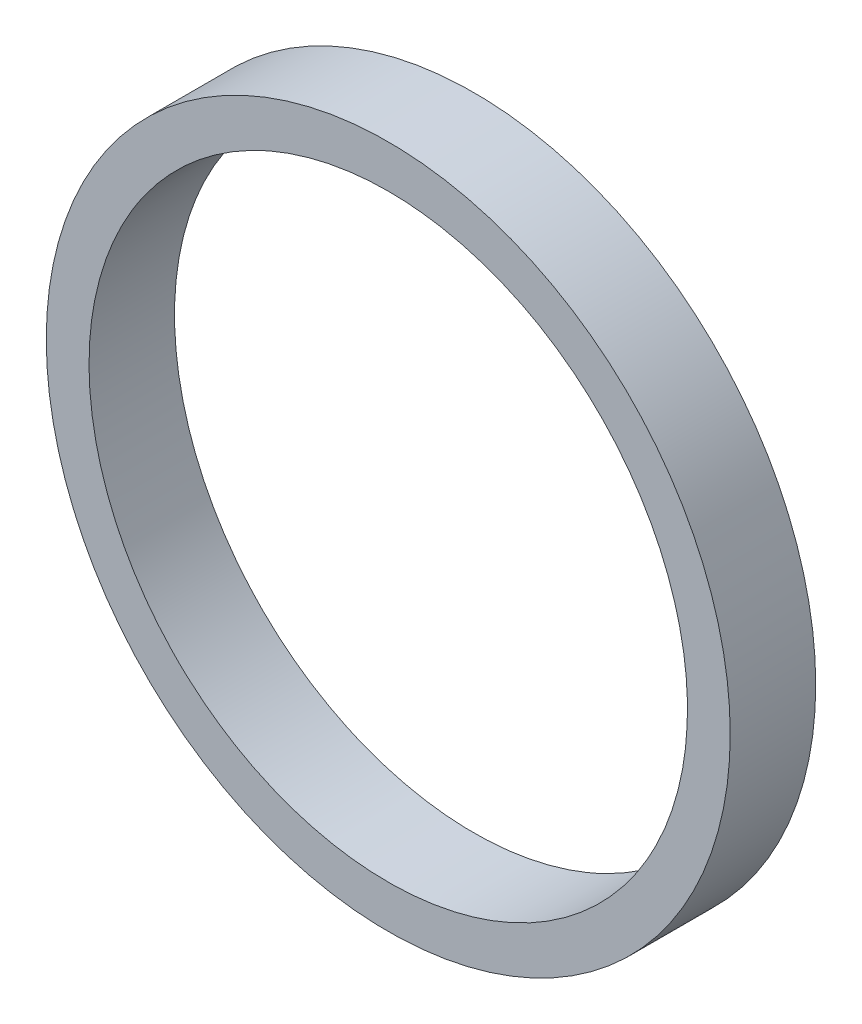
ISO-10303-21;
HEADER;
FILE_DESCRIPTION(('STEP AP214'),'2;1');
FILE_NAME('part.step','',(''),(''),'','','');
FILE_SCHEMA(('AUTOMOTIVE_DESIGN { 1 0 10303 214 1 1 1 1 }'));
ENDSEC;
DATA;
#1=APPLICATION_CONTEXT('core data for automotive mechanical design processes');
#2=APPLICATION_PROTOCOL_DEFINITION('international standard','automotive_design',2000,#1);
#3=PRODUCT_CONTEXT('',#1,'mechanical');
#4=PRODUCT('Part','Part','',(#3));
#5=PRODUCT_RELATED_PRODUCT_CATEGORY('part','',(#4));
#6=PRODUCT_DEFINITION_FORMATION('','',#4);
#7=PRODUCT_DEFINITION_CONTEXT('part definition',#1,'design');
#8=PRODUCT_DEFINITION('design','',#6,#7);
#9=PRODUCT_DEFINITION_SHAPE('','',#8);
#10=(LENGTH_UNIT() NAMED_UNIT(*) SI_UNIT(.MILLI.,.METRE.));
#11=(NAMED_UNIT(*) PLANE_ANGLE_UNIT() SI_UNIT($,.RADIAN.));
#12=(NAMED_UNIT(*) SI_UNIT($,.STERADIAN.) SOLID_ANGLE_UNIT());
#13=UNCERTAINTY_MEASURE_WITH_UNIT(LENGTH_MEASURE(1.E-05),#10,'distance_accuracy_value','');
#14=(GEOMETRIC_REPRESENTATION_CONTEXT(3) GLOBAL_UNCERTAINTY_ASSIGNED_CONTEXT((#13)) GLOBAL_UNIT_ASSIGNED_CONTEXT((#10,
#11,#12)) REPRESENTATION_CONTEXT('',''));
#15=CARTESIAN_POINT('',(0.,0.,0.));
#16=DIRECTION('',(0.,0.,1.));
#17=DIRECTION('',(1.,0.,0.));
#18=AXIS2_PLACEMENT_3D('',#15,#16,#17);
#19=CARTESIAN_POINT('',(0.,0.,10.));
#20=DIRECTION('',(0.,0.,1.));
#21=DIRECTION('',(1.,0.,0.));
#22=AXIS2_PLACEMENT_3D('',#19,#20,#21);
#23=PLANE('',#22);
#24=CARTESIAN_POINT('',(0.,0.,10.));
#25=DIRECTION('',(0.,0.,1.));
#26=DIRECTION('',(1.,0.,0.));
#27=AXIS2_PLACEMENT_3D('',#24,#25,#26);
#28=CIRCLE('',#27,40.);
#29=CARTESIAN_POINT('',(40.,0.,10.));
#30=VERTEX_POINT('',#29);
#31=EDGE_CURVE('E10',#30,#30,#28,.T.);
#32=ORIENTED_EDGE('',*,*,#31,.T.);
#33=EDGE_LOOP('',(#32));
#34=FACE_BOUND('',#33,.T.);
#35=CARTESIAN_POINT('',(-1.0192360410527E-08,34.9989192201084,10.));
#36=CARTESIAN_POINT('',(-0.575875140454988,34.9989668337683,10.));
#37=CARTESIAN_POINT('',(-1.15175923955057,34.9848477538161,10.));
#38=CARTESIAN_POINT('',(-2.29873508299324,34.928374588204,10.));
#39=CARTESIAN_POINT('',(-2.86983506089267,34.8861875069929,10.));
#40=CARTESIAN_POINT('',(-4.00728748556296,34.7738724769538,10.));
#41=CARTESIAN_POINT('',(-4.57364952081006,34.7038416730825,10.));
#42=CARTESIAN_POINT('',(-5.70168014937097,34.5362533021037,10.));
#43=CARTESIAN_POINT('',(-6.26335300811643,34.4387244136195,10.));
#44=CARTESIAN_POINT('',(-7.38205016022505,34.2163480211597,10.));
#45=CARTESIAN_POINT('',(-7.939067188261,34.0914639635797,10.));
#46=CARTESIAN_POINT('',(-9.04840641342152,33.8140522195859,10.));
#47=CARTESIAN_POINT('',(-9.60070305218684,33.6614222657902,10.));
#48=CARTESIAN_POINT('',(-10.7001970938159,33.328215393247,10.));
#49=CARTESIAN_POINT('',(-11.2473482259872,33.1474858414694,10.));
#50=CARTESIAN_POINT('',(-12.3317275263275,32.7595498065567,10.));
#51=CARTESIAN_POINT('',(-12.8689626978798,32.5523628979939,10.));
#52=CARTESIAN_POINT('',(-13.9293538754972,32.1130639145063,10.));
#53=CARTESIAN_POINT('',(-14.4525752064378,31.8811095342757,10.));
#54=CARTESIAN_POINT('',(-15.4854000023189,31.392620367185,10.));
#55=CARTESIAN_POINT('',(-15.9950411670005,31.1361652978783,10.));
#56=CARTESIAN_POINT('',(-17.0007185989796,30.5987016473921,10.));
#57=CARTESIAN_POINT('',(-17.4967647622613,30.31771158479,10.));
#58=CARTESIAN_POINT('',(-18.4753427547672,29.7313522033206,10.));
#59=CARTESIAN_POINT('',(-18.9578508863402,29.4259433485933,10.));
#60=CARTESIAN_POINT('',(-19.9093529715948,28.790705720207,10.));
#61=CARTESIAN_POINT('',(-20.3782841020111,28.4607828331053,10.));
#62=CARTESIAN_POINT('',(-21.3021251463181,27.7762159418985,10.));
#63=CARTESIAN_POINT('',(-21.7569336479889,27.4214350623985,10.));
#64=CARTESIAN_POINT('',(-22.6471341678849,26.6909845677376,10.));
#65=CARTESIAN_POINT('',(-23.0825812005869,26.3153819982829,10.));
#66=CARTESIAN_POINT('',(-23.932145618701,25.5451658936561,10.));
#67=CARTESIAN_POINT('',(-24.3463633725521,25.150663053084,10.));
#68=CARTESIAN_POINT('',(-25.1539339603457,24.343087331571,10.));
#69=CARTESIAN_POINT('',(-25.5473426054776,23.9300702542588,10.));
#70=CARTESIAN_POINT('',(-26.3133246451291,23.0854820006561,10.));
#71=CARTESIAN_POINT('',(-26.6859073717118,22.6539192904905,10.));
#72=CARTESIAN_POINT('',(-27.4101262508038,21.772146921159,10.));
#73=CARTESIAN_POINT('',(-27.7617199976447,21.321902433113,10.));
#74=CARTESIAN_POINT('',(-28.4439317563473,20.402731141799,10.));
#75=CARTESIAN_POINT('',(-28.7744510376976,19.9337310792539,10.));
#76=CARTESIAN_POINT('',(-29.4139521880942,18.9774236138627,10.));
#77=CARTESIAN_POINT('',(-29.7228016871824,18.4900276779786,10.));
#78=CARTESIAN_POINT('',(-30.3147556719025,17.5026156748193,10.));
#79=CARTESIAN_POINT('',(-30.597962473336,17.0026609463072,10.));
#80=CARTESIAN_POINT('',(-31.1381125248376,15.9919470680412,10.));
#81=CARTESIAN_POINT('',(-31.3951790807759,15.4812538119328,10.));
#82=CARTESIAN_POINT('',(-31.8833286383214,14.449183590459,10.));
#83=CARTESIAN_POINT('',(-32.1144759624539,13.9278370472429,10.));
#84=CARTESIAN_POINT('',(-32.5510388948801,12.8745680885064,10.));
#85=CARTESIAN_POINT('',(-32.7564582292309,12.3426472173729,10.));
#86=CARTESIAN_POINT('',(-33.1414595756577,11.2681830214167,10.));
#87=CARTESIAN_POINT('',(-33.320982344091,10.7256184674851,10.));
#88=CARTESIAN_POINT('',(-33.6540627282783,9.62979888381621,10.));
#89=CARTESIAN_POINT('',(-33.8074947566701,9.07650567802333,10.));
#90=CARTESIAN_POINT('',(-34.0876252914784,7.96022114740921,10.));
#91=CARTESIAN_POINT('',(-34.214184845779,7.39719495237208,10.));
#92=CARTESIAN_POINT('',(-34.4388783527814,6.2684487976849,10.));
#93=CARTESIAN_POINT('',(-34.5371522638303,5.70275668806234,10.));
#94=CARTESIAN_POINT('',(-34.7053504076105,4.56986486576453,10.));
#95=CARTESIAN_POINT('',(-34.7754046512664,4.00268447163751,10.));
#96=CARTESIAN_POINT('',(-34.8873679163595,2.86683781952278,10.));
#97=CARTESIAN_POINT('',(-34.9293397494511,2.29817775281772,10.));
#98=CARTESIAN_POINT('',(-34.9854421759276,1.15939766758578,10.));
#99=CARTESIAN_POINT('',(-34.9995682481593,0.589277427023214,10.));
#100=CARTESIAN_POINT('',(-35.000103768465,-0.552432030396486,10.));
#101=CARTESIAN_POINT('',(-34.9864424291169,-1.12402128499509,10.));
#102=CARTESIAN_POINT('',(-34.9309281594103,-2.26869596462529,10.));
#103=CARTESIAN_POINT('',(-34.8889345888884,-2.84177457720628,10.));
#104=CARTESIAN_POINT('',(-34.7766002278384,-3.98755439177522,10.));
#105=CARTESIAN_POINT('',(-34.7061422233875,-4.56024410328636,10.));
#106=CARTESIAN_POINT('',(-34.5374432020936,-5.69820491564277,10.));
#107=CARTESIAN_POINT('',(-34.439361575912,-6.26349965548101,10.));
#108=CARTESIAN_POINT('',(-34.2161454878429,-7.38617310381,10.));
#109=CARTESIAN_POINT('',(-34.0911301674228,-7.94357550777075,10.));
#110=CARTESIAN_POINT('',(-33.8142284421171,-9.05052095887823,10.));
#111=CARTESIAN_POINT('',(-33.6623946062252,-9.60007714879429,10.));
#112=CARTESIAN_POINT('',(-33.3318330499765,-10.6913168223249,10.));
#113=CARTESIAN_POINT('',(-33.1530929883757,-11.2329965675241,10.));
#114=CARTESIAN_POINT('',(-32.7687977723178,-12.3085075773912,10.));
#115=CARTESIAN_POINT('',(-32.5631671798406,-12.8423118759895,10.));
#116=CARTESIAN_POINT('',(-32.1249544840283,-13.9020573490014,10.));
#117=CARTESIAN_POINT('',(-31.892235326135,-14.4279418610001,10.));
#118=CARTESIAN_POINT('',(-31.40039800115,-15.4691540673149,10.));
#119=CARTESIAN_POINT('',(-31.1412025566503,-15.9844452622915,10.));
#120=CARTESIAN_POINT('',(-30.5993353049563,-16.9985660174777,10.));
#121=CARTESIAN_POINT('',(-30.3168134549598,-17.4974757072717,10.));
#122=CARTESIAN_POINT('',(-29.7287365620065,-18.4787906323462,10.));
#123=CARTESIAN_POINT('',(-29.4232791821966,-18.9612544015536,10.));
#124=CARTESIAN_POINT('',(-28.789773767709,-19.9099776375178,10.));
#125=CARTESIAN_POINT('',(-28.4617633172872,-20.3762622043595,10.));
#126=CARTESIAN_POINT('',(-27.7830902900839,-21.2925947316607,10.));
#127=CARTESIAN_POINT('',(-27.4324108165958,-21.7426301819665,10.));
#128=CARTESIAN_POINT('',(-26.7081980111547,-22.6263162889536,10.));
#129=CARTESIAN_POINT('',(-26.3345955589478,-23.0599102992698,10.));
#130=CARTESIAN_POINT('',(-25.5644125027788,-23.9106402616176,10.));
#131=CARTESIAN_POINT('',(-25.1677142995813,-24.3276697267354,10.));
#132=CARTESIAN_POINT('',(-24.3538646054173,-25.1422102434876,10.));
#133=CARTESIAN_POINT('',(-23.936690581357,-25.5396987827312,10.));
#134=CARTESIAN_POINT('',(-23.0854296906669,-26.3115787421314,10.));
#135=CARTESIAN_POINT('',(-22.6514417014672,-26.686079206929,10.));
#136=CARTESIAN_POINT('',(-21.7674638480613,-27.4118191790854,10.));
#137=CARTESIAN_POINT('',(-21.317548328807,-27.7631492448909,10.));
#138=CARTESIAN_POINT('',(-20.4016635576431,-28.4429056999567,10.));
#139=CARTESIAN_POINT('',(-19.9357164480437,-28.7713619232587,10.));
#140=CARTESIAN_POINT('',(-18.9878583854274,-29.4054977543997,10.));
#141=CARTESIAN_POINT('',(-18.5059310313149,-29.711152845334,10.));
#142=CARTESIAN_POINT('',(-17.5260053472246,-30.2995541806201,10.));
#143=CARTESIAN_POINT('',(-17.027957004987,-30.5822171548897,10.));
#144=CARTESIAN_POINT('',(-16.015567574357,-31.1242745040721,10.));
#145=CARTESIAN_POINT('',(-15.5011476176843,-31.3835215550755,10.));
#146=CARTESIAN_POINT('',(-14.4602374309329,-31.8764742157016,10.));
#147=CARTESIAN_POINT('',(-13.9337476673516,-32.110180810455,10.));
#148=CARTESIAN_POINT('',(-12.8730032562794,-32.5500233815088,10.));
#149=CARTESIAN_POINT('',(-12.3388125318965,-32.7563135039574,10.));
#150=CARTESIAN_POINT('',(-11.262813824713,-33.1418031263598,10.));
#151=CARTESIAN_POINT('',(-10.7210383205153,-33.3210932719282,10.));
#152=CARTESIAN_POINT('',(-9.62988582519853,-33.6526322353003,10.));
#153=CARTESIAN_POINT('',(-9.0805172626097,-33.8049087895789,10.));
#154=CARTESIAN_POINT('',(-7.97424558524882,-34.0826367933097,10.));
#155=CARTESIAN_POINT('',(-7.41733318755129,-34.2080512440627,10.));
#156=CARTESIAN_POINT('',(-6.29567663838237,-34.4320845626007,10.));
#157=CARTESIAN_POINT('',(-5.73090923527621,-34.530587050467,10.));
#158=CARTESIAN_POINT('',(-4.59430584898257,-34.7001565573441,10.));
#159=CARTESIAN_POINT('',(-4.02244846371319,-34.7710801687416,10.));
#160=CARTESIAN_POINT('',(-2.87665345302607,-34.8845723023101,10.));
#161=CARTESIAN_POINT('',(-2.30271935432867,-34.9271764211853,10.));
#162=CARTESIAN_POINT('',(-1.15664677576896,-34.9838106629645,10.));
#163=CARTESIAN_POINT('',(-0.584516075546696,-34.9979984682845,10.));
#164=CARTESIAN_POINT('',(0.557970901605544,-34.9984610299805,10.));
#165=CARTESIAN_POINT('',(1.12832714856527,-34.984822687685,10.));
#166=CARTESIAN_POINT('',(2.26727603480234,-34.9296906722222,10.));
#167=CARTESIAN_POINT('',(2.83586966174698,-34.8882174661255,10.));
#168=CARTESIAN_POINT('',(3.97128058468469,-34.7772955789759,10.));
#169=CARTESIAN_POINT('',(4.53809332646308,-34.7078002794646,10.));
#170=CARTESIAN_POINT('',(5.66994702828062,-34.5408128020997,10.));
#171=CARTESIAN_POINT('',(6.23497123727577,-34.4432071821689,10.));
#172=CARTESIAN_POINT('',(7.36294372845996,-34.2198206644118,10.));
#173=CARTESIAN_POINT('',(7.9258592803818,-34.0938744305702,10.));
#174=CARTESIAN_POINT('',(9.04302068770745,-33.8147207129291,10.));
#175=CARTESIAN_POINT('',(9.59728814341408,-33.6615996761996,10.));
#176=CARTESIAN_POINT('',(10.6947303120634,-33.3291523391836,10.));
#177=CARTESIAN_POINT('',(11.2379479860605,-33.1499678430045,10.));
#178=CARTESIAN_POINT('',(12.3134141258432,-32.7656995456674,10.));
#179=CARTESIAN_POINT('',(12.8456892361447,-32.5606903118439,10.));
#180=CARTESIAN_POINT('',(13.8993818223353,-32.1250490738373,10.));
#181=CARTESIAN_POINT('',(14.4208038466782,-31.8944280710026,10.));
#182=CARTESIAN_POINT('',(15.4527568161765,-31.4074778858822,10.));
#183=CARTESIAN_POINT('',(15.9632643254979,-31.1510990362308,10.));
#184=CARTESIAN_POINT('',(16.973353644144,-30.6125177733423,10.));
#185=CARTESIAN_POINT('',(17.4728776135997,-30.3302068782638,10.));
#186=CARTESIAN_POINT('',(18.460202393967,-29.7396807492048,10.));
#187=CARTESIAN_POINT('',(18.9479211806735,-29.431328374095,10.));
#188=CARTESIAN_POINT('',(19.9055694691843,-28.7923566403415,10.));
#189=CARTESIAN_POINT('',(20.3755654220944,-28.4618368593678,10.));
#190=CARTESIAN_POINT('',(21.2964286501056,-27.7797457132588,10.));
#191=CARTESIAN_POINT('',(21.7473791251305,-27.4282867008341,10.));
#192=CARTESIAN_POINT('',(22.6302974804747,-26.7044946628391,10.));
#193=CARTESIAN_POINT('',(23.0623105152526,-26.3322167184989,10.));
#194=CARTESIAN_POINT('',(23.9075676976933,-25.5670380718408,10.));
#195=CARTESIAN_POINT('',(24.3208141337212,-25.1741398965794,10.));
#196=CARTESIAN_POINT('',(25.1286482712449,-24.3678204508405,10.));
#197=CARTESIAN_POINT('',(25.5231916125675,-23.9543547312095,10.));
#198=CARTESIAN_POINT('',(26.2933173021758,-23.1065649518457,10.));
#199=CARTESIAN_POINT('',(26.6688016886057,-22.6721518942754,10.));
#200=CARTESIAN_POINT('',(27.3998100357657,-21.7831901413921,10.));
#201=CARTESIAN_POINT('',(27.7552246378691,-21.3285515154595,10.));
#202=CARTESIAN_POINT('',(28.4413595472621,-20.4045973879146,10.));
#203=CARTESIAN_POINT('',(28.7721963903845,-19.9353684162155,10.));
#204=CARTESIAN_POINT('',(29.4090252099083,-18.9834857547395,10.));
#205=CARTESIAN_POINT('',(29.7151250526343,-18.5009042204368,10.));
#206=CARTESIAN_POINT('',(30.3026703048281,-17.5224160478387,10.));
#207=CARTESIAN_POINT('',(30.5841690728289,-17.0265414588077,10.));
#208=CARTESIAN_POINT('',(31.1225074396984,-16.0214724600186,10.));
#209=CARTESIAN_POINT('',(31.3793427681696,-15.5122757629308,10.));
#210=CARTESIAN_POINT('',(31.8684478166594,-14.4806130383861,10.));
#211=CARTESIAN_POINT('',(32.1006524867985,-13.9581161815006,10.));
#212=CARTESIAN_POINT('',(32.540409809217,-12.8997802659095,10.));
#213=CARTESIAN_POINT('',(32.7478333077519,-12.3638875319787,10.));
#214=CARTESIAN_POINT('',(33.1368093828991,-11.2803041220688,10.));
#215=CARTESIAN_POINT('',(33.318252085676,-10.7325739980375,10.));
#216=CARTESIAN_POINT('',(33.6529333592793,-9.63196091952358,10.));
#217=CARTESIAN_POINT('',(33.8063262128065,-9.07912487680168,10.));
#218=CARTESIAN_POINT('',(34.0850791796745,-7.96897733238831,10.));
#219=CARTESIAN_POINT('',(34.2105578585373,-7.41169559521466,10.));
#220=CARTESIAN_POINT('',(34.4340322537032,-6.29275988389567,10.));
#221=CARTESIAN_POINT('',(34.5320801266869,-5.73111632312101,10.));
#222=CARTESIAN_POINT('',(34.7006499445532,-4.6034408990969,10.));
#223=CARTESIAN_POINT('',(34.7711590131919,-4.03740710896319,10.));
#224=CARTESIAN_POINT('',(34.8844290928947,-2.90091901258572,10.));
#225=CARTESIAN_POINT('',(34.9271093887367,-2.33045666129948,10.));
#226=CARTESIAN_POINT('',(34.9846018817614,-1.18508136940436,10.));
#227=CARTESIAN_POINT('',(34.9992641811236,-0.610160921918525,10.));
#228=CARTESIAN_POINT('',(35.0003805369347,0.541393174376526,10.));
#229=CARTESIAN_POINT('',(34.9867518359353,1.11802690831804,10.));
#230=CARTESIAN_POINT('',(34.9311467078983,2.26645636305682,10.));
#231=CARTESIAN_POINT('',(34.8893409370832,2.83826034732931,10.));
#232=CARTESIAN_POINT('',(34.7779555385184,3.9768338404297,10.));
#233=CARTESIAN_POINT('',(34.7084883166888,4.54361434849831,10.));
#234=CARTESIAN_POINT('',(34.5420052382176,5.67217843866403,10.));
#235=CARTESIAN_POINT('',(34.4450341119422,6.23396861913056,10.));
#236=CARTESIAN_POINT('',(34.2237244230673,7.35258278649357,10.));
#237=CARTESIAN_POINT('',(34.0993647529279,7.90940259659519,10.));
#238=CARTESIAN_POINT('',(33.8231312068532,9.01806067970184,10.));
#239=CARTESIAN_POINT('',(33.6711710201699,9.56987745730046,10.));
#240=CARTESIAN_POINT('',(33.3392776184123,10.6686841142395,10.));
#241=CARTESIAN_POINT('',(33.1591803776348,11.2156244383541,10.));
#242=CARTESIAN_POINT('',(32.7722644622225,12.3003796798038,10.));
#243=CARTESIAN_POINT('',(32.5654280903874,12.8381882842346,10.));
#244=CARTESIAN_POINT('',(32.1266893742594,13.8999428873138,10.));
#245=CARTESIAN_POINT('',(31.8949345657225,14.4239498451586,10.));
#246=CARTESIAN_POINT('',(31.4069152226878,15.4580379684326,10.));
#247=CARTESIAN_POINT('',(31.1507452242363,15.9681637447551,10.));
#248=CARTESIAN_POINT('',(30.6139661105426,16.974527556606,10.));
#249=CARTESIAN_POINT('',(30.3333896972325,17.4707830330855,10.));
#250=CARTESIAN_POINT('',(29.7480091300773,18.4495167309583,10.));
#251=CARTESIAN_POINT('',(29.443179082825,18.931979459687,10.));
#252=CARTESIAN_POINT('',(28.8092989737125,19.8831906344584,10.));
#253=CARTESIAN_POINT('',(28.4801671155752,20.3518845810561,10.));
#254=CARTESIAN_POINT('',(27.7972540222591,21.2752079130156,10.));
#255=CARTESIAN_POINT('',(27.4433398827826,21.7297390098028,10.));
#256=CARTESIAN_POINT('',(26.7136104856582,22.6207677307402,10.));
#257=CARTESIAN_POINT('',(26.3377980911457,23.0572676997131,10.));
#258=CARTESIAN_POINT('',(25.5673000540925,23.9086344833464,10.));
#259=CARTESIAN_POINT('',(25.1727378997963,24.3236130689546,10.));
#260=CARTESIAN_POINT('',(24.3652181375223,25.1324476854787,10.));
#261=CARTESIAN_POINT('',(23.9523277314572,25.5263708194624,10.));
#262=CARTESIAN_POINT('',(23.1081997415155,26.2931620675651,10.));
#263=CARTESIAN_POINT('',(22.6769812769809,26.6660512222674,10.));
#264=CARTESIAN_POINT('',(21.7961324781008,27.3906884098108,10.));
#265=CARTESIAN_POINT('',(21.3464774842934,27.7424064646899,10.));
#266=CARTESIAN_POINT('',(20.4287782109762,28.4247461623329,10.));
#267=CARTESIAN_POINT('',(19.9606705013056,28.7552824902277,10.));
#268=CARTESIAN_POINT('',(19.0061341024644,29.3947520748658,10.));
#269=CARTESIAN_POINT('',(18.5196177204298,29.7035544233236,10.));
#270=CARTESIAN_POINT('',(17.5324263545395,30.2966810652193,10.));
#271=CARTESIAN_POINT('',(17.0317632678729,30.5810251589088,10.));
#272=CARTESIAN_POINT('',(16.0200416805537,31.1229425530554,10.));
#273=CARTESIAN_POINT('',(15.5090642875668,31.3806672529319,10.));
#274=CARTESIAN_POINT('',(14.4766966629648,31.8699874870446,10.));
#275=CARTESIAN_POINT('',(13.9553437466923,32.1016617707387,10.));
#276=CARTESIAN_POINT('',(12.9023271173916,32.5391384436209,10.));
#277=CARTESIAN_POINT('',(12.3706709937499,32.7449590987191,10.));
#278=CARTESIAN_POINT('',(11.2970271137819,33.1306770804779,10.));
#279=CARTESIAN_POINT('',(10.7550234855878,33.3105302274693,10.));
#280=CARTESIAN_POINT('',(9.66063647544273,33.6442261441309,10.));
#281=CARTESIAN_POINT('',(9.10821963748,33.7979592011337,10.));
#282=CARTESIAN_POINT('',(7.99309966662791,34.0789245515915,10.));
#283=CARTESIAN_POINT('',(7.43035432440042,34.2059893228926,10.));
#284=CARTESIAN_POINT('',(6.29979523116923,34.4321867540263,10.));
#285=CARTESIAN_POINT('',(5.73198638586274,34.5313439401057,10.));
#286=CARTESIAN_POINT('',(4.59336651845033,34.7013126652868,10.));
#287=CARTESIAN_POINT('',(4.02256439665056,34.7721837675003,10.));
#288=CARTESIAN_POINT('',(2.87796495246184,34.8855621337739,10.));
#289=CARTESIAN_POINT('',(2.30416672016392,34.928060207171,10.));
#290=CARTESIAN_POINT('',(1.1535785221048,34.9848015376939,10.));
#291=CARTESIAN_POINT('',(0.576784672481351,34.998966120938,10.));
#292=CARTESIAN_POINT('',(-1.0192360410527E-08,34.9989192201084,10.));
#293=B_SPLINE_CURVE_WITH_KNOTS('',3,(#35,#36,#37,#38,#39,#40,#41,#42,#43,#44,#45,#46,#47,#48,
#49,#50,#51,#52,#53,#54,#55,#56,#57,#58,#59,#60,#61,#62,#63,#64,#65,#66,#67,#68,#69,#70,#71,#72,
#73,#74,#75,#76,#77,#78,#79,#80,#81,#82,#83,#84,#85,#86,#87,#88,#89,#90,#91,#92,#93,#94,#95,#96,
#97,#98,#99,#100,#101,#102,#103,#104,#105,#106,#107,#108,#109,#110,#111,#112,#113,#114,#115,
#116,#117,#118,#119,#120,#121,#122,#123,#124,#125,#126,#127,#128,#129,#130,#131,#132,#133,#134,
#135,#136,#137,#138,#139,#140,#141,#142,#143,#144,#145,#146,#147,#148,#149,#150,#151,#152,#153,
#154,#155,#156,#157,#158,#159,#160,#161,#162,#163,#164,#165,#166,#167,#168,#169,#170,#171,#172,
#173,#174,#175,#176,#177,#178,#179,#180,#181,#182,#183,#184,#185,#186,#187,#188,#189,#190,#191,
#192,#193,#194,#195,#196,#197,#198,#199,#200,#201,#202,#203,#204,#205,#206,#207,#208,#209,#210,
#211,#212,#213,#214,#215,#216,#217,#218,#219,#220,#221,#222,#223,#224,#225,#226,#227,#228,#229,
#230,#231,#232,#233,#234,#235,#236,#237,#238,#239,#240,#241,#242,#243,#244,#245,#246,#247,#248,
#249,#250,#251,#252,#253,#254,#255,#256,#257,#258,#259,#260,#261,#262,#263,#264,#265,#266,#267,
#268,#269,#270,#271,#272,#273,#274,#275,#276,#277,#278,#279,#280,#281,#282,#283,#284,#285,#286,
#287,#288,#289,#290,#291,#292),.UNSPECIFIED.,.F.,.F.,(4,2,2,2,2,2,2,2,2,2,2,2,2,2,2,2,2,2,2,2,2,
2,2,2,2,2,2,2,2,2,2,2,2,2,2,2,2,2,2,2,2,2,2,2,2,2,2,2,2,2,2,2,2,2,2,2,2,2,2,2,2,2,2,2,2,2,2,2,2,
2,2,2,2,2,2,2,2,2,2,2,2,2,2,2,2,2,2,2,2,2,2,2,2,2,2,2,2,2,2,2,2,2,2,2,2,2,2,2,2,2,2,2,2,2,2,2,2,
2,2,2,2,2,2,2,2,2,2,2,4),(0.,1.72746341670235,3.44473927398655,5.15607551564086,
6.86563351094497,8.57749000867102,10.2957890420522,12.0237705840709,13.7504810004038,
15.4667880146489,17.1776894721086,18.8873105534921,20.5997579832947,22.3191581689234,
24.048910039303,25.7733835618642,27.4887634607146,29.1992813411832,30.909026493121,
32.6221165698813,34.3427179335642,36.0730497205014,37.7961414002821,39.510686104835,
41.2208770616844,42.9308200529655,44.6446148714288,46.3664388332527,48.0969601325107,
49.8187654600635,51.5325449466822,53.2424783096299,54.9526892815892,56.6672624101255,
58.3904098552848,60.1207265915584,61.8412569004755,63.5543272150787,65.2640761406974,
66.9746116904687,68.690053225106,70.4145857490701,72.1443039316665,73.8636589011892,
75.5760678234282,77.2856891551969,78.9965998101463,80.7129504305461,82.4389708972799,
84.1669353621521,85.8859428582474,87.5977759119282,89.3073327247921,91.0187020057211,
92.7360163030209,94.4634756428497,96.1908683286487,97.9080962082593,99.6194238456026,
101.328984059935,103.040884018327,104.760073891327,106.488087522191,108.213924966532,
109.930158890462,111.641041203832,113.35066687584,115.063148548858,116.782640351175,
118.512436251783,120.236824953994,121.952160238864,123.662651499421,125.372410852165,
127.085532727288,128.806179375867,130.536532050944,132.25957430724,133.974084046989,
135.684254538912,137.394215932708,139.108048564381,140.829946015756,142.560465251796,
144.282172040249,145.995913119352,147.705839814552,149.416062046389,151.130694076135,
152.853904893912,154.584200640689,156.304672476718,158.017690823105,159.72742956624,
161.437966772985,163.153443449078,164.878072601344,166.60775378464,168.327052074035,
170.039433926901,171.749046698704,173.459981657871,175.176362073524,176.903149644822,
178.631085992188,180.349302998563,182.061118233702,183.770674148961,185.482080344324,
187.199535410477,188.927035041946,190.654309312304,192.371462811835,194.082770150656,
195.792334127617,197.50426448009,199.222705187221,200.950739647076,202.677361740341,
204.393549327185,206.104400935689,207.814036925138,209.526548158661,211.246083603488,
212.976117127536,214.704625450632,216.429474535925,218.154882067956,219.885073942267),.UNSPECIFIED.);
#294=CARTESIAN_POINT('',(-1.0192360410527E-08,34.9989192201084,10.));
#295=VERTEX_POINT('',#294);
#296=EDGE_CURVE('E56',#295,#295,#293,.T.);
#297=ORIENTED_EDGE('',*,*,#296,.F.);
#298=EDGE_LOOP('',(#297));
#299=FACE_BOUND('',#298,.T.);
#300=ADVANCED_FACE('F41',(#34,#299),#23,.T.);
#301=CARTESIAN_POINT('',(0.,0.,0.));
#302=DIRECTION('',(0.,0.,1.));
#303=DIRECTION('',(1.,0.,0.));
#304=AXIS2_PLACEMENT_3D('',#301,#302,#303);
#305=PLANE('',#304);
#306=CARTESIAN_POINT('',(0.,0.,0.));
#307=DIRECTION('',(0.,0.,1.));
#308=DIRECTION('',(1.,0.,0.));
#309=AXIS2_PLACEMENT_3D('',#306,#307,#308);
#310=CIRCLE('',#309,40.);
#311=CARTESIAN_POINT('',(40.,0.,0.));
#312=VERTEX_POINT('',#311);
#313=EDGE_CURVE('E51',#312,#312,#310,.T.);
#314=ORIENTED_EDGE('',*,*,#313,.F.);
#315=EDGE_LOOP('',(#314));
#316=FACE_BOUND('',#315,.T.);
#317=CARTESIAN_POINT('',(-1.0192360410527E-08,34.9989192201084,0.));
#318=CARTESIAN_POINT('',(0.576784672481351,34.998966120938,0.));
#319=CARTESIAN_POINT('',(1.1535785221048,34.9848015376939,0.));
#320=CARTESIAN_POINT('',(2.30416672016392,34.928060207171,0.));
#321=CARTESIAN_POINT('',(2.87796495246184,34.8855621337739,0.));
#322=CARTESIAN_POINT('',(4.02256439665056,34.7721837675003,0.));
#323=CARTESIAN_POINT('',(4.59336651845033,34.7013126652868,0.));
#324=CARTESIAN_POINT('',(5.73198638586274,34.5313439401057,0.));
#325=CARTESIAN_POINT('',(6.29979523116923,34.4321867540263,0.));
#326=CARTESIAN_POINT('',(7.43035432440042,34.2059893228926,0.));
#327=CARTESIAN_POINT('',(7.99309966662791,34.0789245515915,0.));
#328=CARTESIAN_POINT('',(9.10821963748,33.7979592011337,0.));
#329=CARTESIAN_POINT('',(9.66063647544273,33.6442261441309,0.));
#330=CARTESIAN_POINT('',(10.7550234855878,33.3105302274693,0.));
#331=CARTESIAN_POINT('',(11.2970271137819,33.1306770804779,0.));
#332=CARTESIAN_POINT('',(12.3706709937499,32.7449590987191,0.));
#333=CARTESIAN_POINT('',(12.9023271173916,32.5391384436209,0.));
#334=CARTESIAN_POINT('',(13.9553437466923,32.1016617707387,0.));
#335=CARTESIAN_POINT('',(14.4766966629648,31.8699874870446,0.));
#336=CARTESIAN_POINT('',(15.5090642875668,31.3806672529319,0.));
#337=CARTESIAN_POINT('',(16.0200416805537,31.1229425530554,0.));
#338=CARTESIAN_POINT('',(17.0317632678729,30.5810251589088,0.));
#339=CARTESIAN_POINT('',(17.5324263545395,30.2966810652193,0.));
#340=CARTESIAN_POINT('',(18.5196177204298,29.7035544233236,0.));
#341=CARTESIAN_POINT('',(19.0061341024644,29.3947520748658,0.));
#342=CARTESIAN_POINT('',(19.9606705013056,28.7552824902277,0.));
#343=CARTESIAN_POINT('',(20.4287782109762,28.4247461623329,0.));
#344=CARTESIAN_POINT('',(21.3464774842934,27.7424064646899,0.));
#345=CARTESIAN_POINT('',(21.7961324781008,27.3906884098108,0.));
#346=CARTESIAN_POINT('',(22.6769812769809,26.6660512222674,0.));
#347=CARTESIAN_POINT('',(23.1081997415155,26.2931620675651,0.));
#348=CARTESIAN_POINT('',(23.9523277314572,25.5263708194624,0.));
#349=CARTESIAN_POINT('',(24.3652181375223,25.1324476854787,0.));
#350=CARTESIAN_POINT('',(25.1727378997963,24.3236130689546,0.));
#351=CARTESIAN_POINT('',(25.5673000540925,23.9086344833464,0.));
#352=CARTESIAN_POINT('',(26.3377980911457,23.0572676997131,0.));
#353=CARTESIAN_POINT('',(26.7136104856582,22.6207677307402,0.));
#354=CARTESIAN_POINT('',(27.4433398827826,21.7297390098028,0.));
#355=CARTESIAN_POINT('',(27.7972540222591,21.2752079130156,0.));
#356=CARTESIAN_POINT('',(28.4801671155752,20.3518845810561,0.));
#357=CARTESIAN_POINT('',(28.8092989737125,19.8831906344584,0.));
#358=CARTESIAN_POINT('',(29.443179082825,18.931979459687,0.));
#359=CARTESIAN_POINT('',(29.7480091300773,18.4495167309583,0.));
#360=CARTESIAN_POINT('',(30.3333896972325,17.4707830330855,0.));
#361=CARTESIAN_POINT('',(30.6139661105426,16.974527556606,0.));
#362=CARTESIAN_POINT('',(31.1507452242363,15.9681637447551,0.));
#363=CARTESIAN_POINT('',(31.4069152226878,15.4580379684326,0.));
#364=CARTESIAN_POINT('',(31.8949345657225,14.4239498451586,0.));
#365=CARTESIAN_POINT('',(32.1266893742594,13.8999428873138,0.));
#366=CARTESIAN_POINT('',(32.5654280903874,12.8381882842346,0.));
#367=CARTESIAN_POINT('',(32.7722644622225,12.3003796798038,0.));
#368=CARTESIAN_POINT('',(33.1591803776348,11.2156244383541,0.));
#369=CARTESIAN_POINT('',(33.3392776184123,10.6686841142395,0.));
#370=CARTESIAN_POINT('',(33.6711710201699,9.56987745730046,0.));
#371=CARTESIAN_POINT('',(33.8231312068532,9.01806067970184,0.));
#372=CARTESIAN_POINT('',(34.0993647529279,7.90940259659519,0.));
#373=CARTESIAN_POINT('',(34.2237244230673,7.35258278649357,0.));
#374=CARTESIAN_POINT('',(34.4450341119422,6.23396861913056,0.));
#375=CARTESIAN_POINT('',(34.5420052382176,5.67217843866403,0.));
#376=CARTESIAN_POINT('',(34.7084883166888,4.54361434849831,0.));
#377=CARTESIAN_POINT('',(34.7779555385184,3.9768338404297,0.));
#378=CARTESIAN_POINT('',(34.8893409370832,2.83826034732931,0.));
#379=CARTESIAN_POINT('',(34.9311467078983,2.26645636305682,0.));
#380=CARTESIAN_POINT('',(34.9867518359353,1.11802690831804,0.));
#381=CARTESIAN_POINT('',(35.0003805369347,0.541393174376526,0.));
#382=CARTESIAN_POINT('',(34.9992641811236,-0.610160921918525,0.));
#383=CARTESIAN_POINT('',(34.9846018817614,-1.18508136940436,0.));
#384=CARTESIAN_POINT('',(34.9271093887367,-2.33045666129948,0.));
#385=CARTESIAN_POINT('',(34.8844290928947,-2.90091901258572,0.));
#386=CARTESIAN_POINT('',(34.7711590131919,-4.03740710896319,0.));
#387=CARTESIAN_POINT('',(34.7006499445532,-4.6034408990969,0.));
#388=CARTESIAN_POINT('',(34.5320801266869,-5.73111632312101,0.));
#389=CARTESIAN_POINT('',(34.4340322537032,-6.29275988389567,0.));
#390=CARTESIAN_POINT('',(34.2105578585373,-7.41169559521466,0.));
#391=CARTESIAN_POINT('',(34.0850791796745,-7.96897733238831,0.));
#392=CARTESIAN_POINT('',(33.8063262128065,-9.07912487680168,0.));
#393=CARTESIAN_POINT('',(33.6529333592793,-9.63196091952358,0.));
#394=CARTESIAN_POINT('',(33.318252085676,-10.7325739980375,0.));
#395=CARTESIAN_POINT('',(33.1368093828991,-11.2803041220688,0.));
#396=CARTESIAN_POINT('',(32.7478333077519,-12.3638875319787,0.));
#397=CARTESIAN_POINT('',(32.540409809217,-12.8997802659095,0.));
#398=CARTESIAN_POINT('',(32.1006524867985,-13.9581161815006,0.));
#399=CARTESIAN_POINT('',(31.8684478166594,-14.4806130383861,0.));
#400=CARTESIAN_POINT('',(31.3793427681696,-15.5122757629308,0.));
#401=CARTESIAN_POINT('',(31.1225074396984,-16.0214724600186,0.));
#402=CARTESIAN_POINT('',(30.5841690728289,-17.0265414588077,0.));
#403=CARTESIAN_POINT('',(30.3026703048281,-17.5224160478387,0.));
#404=CARTESIAN_POINT('',(29.7151250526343,-18.5009042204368,0.));
#405=CARTESIAN_POINT('',(29.4090252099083,-18.9834857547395,0.));
#406=CARTESIAN_POINT('',(28.7721963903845,-19.9353684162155,0.));
#407=CARTESIAN_POINT('',(28.4413595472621,-20.4045973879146,0.));
#408=CARTESIAN_POINT('',(27.7552246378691,-21.3285515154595,0.));
#409=CARTESIAN_POINT('',(27.3998100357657,-21.7831901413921,0.));
#410=CARTESIAN_POINT('',(26.6688016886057,-22.6721518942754,0.));
#411=CARTESIAN_POINT('',(26.2933173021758,-23.1065649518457,0.));
#412=CARTESIAN_POINT('',(25.5231916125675,-23.9543547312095,0.));
#413=CARTESIAN_POINT('',(25.1286482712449,-24.3678204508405,0.));
#414=CARTESIAN_POINT('',(24.3208141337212,-25.1741398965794,0.));
#415=CARTESIAN_POINT('',(23.9075676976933,-25.5670380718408,0.));
#416=CARTESIAN_POINT('',(23.0623105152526,-26.3322167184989,0.));
#417=CARTESIAN_POINT('',(22.6302974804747,-26.7044946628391,0.));
#418=CARTESIAN_POINT('',(21.7473791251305,-27.4282867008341,0.));
#419=CARTESIAN_POINT('',(21.2964286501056,-27.7797457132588,0.));
#420=CARTESIAN_POINT('',(20.3755654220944,-28.4618368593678,0.));
#421=CARTESIAN_POINT('',(19.9055694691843,-28.7923566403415,0.));
#422=CARTESIAN_POINT('',(18.9479211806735,-29.431328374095,0.));
#423=CARTESIAN_POINT('',(18.460202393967,-29.7396807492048,0.));
#424=CARTESIAN_POINT('',(17.4728776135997,-30.3302068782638,0.));
#425=CARTESIAN_POINT('',(16.973353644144,-30.6125177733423,0.));
#426=CARTESIAN_POINT('',(15.9632643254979,-31.1510990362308,0.));
#427=CARTESIAN_POINT('',(15.4527568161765,-31.4074778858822,0.));
#428=CARTESIAN_POINT('',(14.4208038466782,-31.8944280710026,0.));
#429=CARTESIAN_POINT('',(13.8993818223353,-32.1250490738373,0.));
#430=CARTESIAN_POINT('',(12.8456892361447,-32.5606903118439,0.));
#431=CARTESIAN_POINT('',(12.3134141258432,-32.7656995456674,0.));
#432=CARTESIAN_POINT('',(11.2379479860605,-33.1499678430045,0.));
#433=CARTESIAN_POINT('',(10.6947303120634,-33.3291523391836,0.));
#434=CARTESIAN_POINT('',(9.59728814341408,-33.6615996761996,0.));
#435=CARTESIAN_POINT('',(9.04302068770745,-33.8147207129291,0.));
#436=CARTESIAN_POINT('',(7.9258592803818,-34.0938744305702,0.));
#437=CARTESIAN_POINT('',(7.36294372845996,-34.2198206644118,0.));
#438=CARTESIAN_POINT('',(6.23497123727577,-34.4432071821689,0.));
#439=CARTESIAN_POINT('',(5.66994702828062,-34.5408128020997,0.));
#440=CARTESIAN_POINT('',(4.53809332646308,-34.7078002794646,0.));
#441=CARTESIAN_POINT('',(3.97128058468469,-34.7772955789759,0.));
#442=CARTESIAN_POINT('',(2.83586966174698,-34.8882174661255,0.));
#443=CARTESIAN_POINT('',(2.26727603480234,-34.9296906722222,0.));
#444=CARTESIAN_POINT('',(1.12832714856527,-34.984822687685,0.));
#445=CARTESIAN_POINT('',(0.557970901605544,-34.9984610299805,0.));
#446=CARTESIAN_POINT('',(-0.584516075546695,-34.9979984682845,0.));
#447=CARTESIAN_POINT('',(-1.15664677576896,-34.9838106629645,0.));
#448=CARTESIAN_POINT('',(-2.30271935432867,-34.9271764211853,0.));
#449=CARTESIAN_POINT('',(-2.87665345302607,-34.8845723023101,0.));
#450=CARTESIAN_POINT('',(-4.02244846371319,-34.7710801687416,0.));
#451=CARTESIAN_POINT('',(-4.59430584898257,-34.7001565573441,0.));
#452=CARTESIAN_POINT('',(-5.73090923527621,-34.530587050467,0.));
#453=CARTESIAN_POINT('',(-6.29567663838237,-34.4320845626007,0.));
#454=CARTESIAN_POINT('',(-7.41733318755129,-34.2080512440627,0.));
#455=CARTESIAN_POINT('',(-7.97424558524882,-34.0826367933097,0.));
#456=CARTESIAN_POINT('',(-9.0805172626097,-33.8049087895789,0.));
#457=CARTESIAN_POINT('',(-9.62988582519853,-33.6526322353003,0.));
#458=CARTESIAN_POINT('',(-10.7210383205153,-33.3210932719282,0.));
#459=CARTESIAN_POINT('',(-11.262813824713,-33.1418031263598,0.));
#460=CARTESIAN_POINT('',(-12.3388125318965,-32.7563135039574,0.));
#461=CARTESIAN_POINT('',(-12.8730032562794,-32.5500233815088,0.));
#462=CARTESIAN_POINT('',(-13.9337476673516,-32.110180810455,0.));
#463=CARTESIAN_POINT('',(-14.4602374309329,-31.8764742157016,0.));
#464=CARTESIAN_POINT('',(-15.5011476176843,-31.3835215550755,0.));
#465=CARTESIAN_POINT('',(-16.015567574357,-31.1242745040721,0.));
#466=CARTESIAN_POINT('',(-17.027957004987,-30.5822171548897,0.));
#467=CARTESIAN_POINT('',(-17.5260053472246,-30.2995541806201,0.));
#468=CARTESIAN_POINT('',(-18.5059310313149,-29.711152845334,0.));
#469=CARTESIAN_POINT('',(-18.9878583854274,-29.4054977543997,0.));
#470=CARTESIAN_POINT('',(-19.9357164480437,-28.7713619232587,0.));
#471=CARTESIAN_POINT('',(-20.4016635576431,-28.4429056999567,0.));
#472=CARTESIAN_POINT('',(-21.317548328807,-27.7631492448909,0.));
#473=CARTESIAN_POINT('',(-21.7674638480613,-27.4118191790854,0.));
#474=CARTESIAN_POINT('',(-22.6514417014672,-26.686079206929,0.));
#475=CARTESIAN_POINT('',(-23.0854296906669,-26.3115787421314,0.));
#476=CARTESIAN_POINT('',(-23.936690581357,-25.5396987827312,0.));
#477=CARTESIAN_POINT('',(-24.3538646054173,-25.1422102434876,0.));
#478=CARTESIAN_POINT('',(-25.1677142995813,-24.3276697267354,0.));
#479=CARTESIAN_POINT('',(-25.5644125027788,-23.9106402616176,0.));
#480=CARTESIAN_POINT('',(-26.3345955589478,-23.0599102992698,0.));
#481=CARTESIAN_POINT('',(-26.7081980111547,-22.6263162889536,0.));
#482=CARTESIAN_POINT('',(-27.4324108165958,-21.7426301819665,0.));
#483=CARTESIAN_POINT('',(-27.7830902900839,-21.2925947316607,0.));
#484=CARTESIAN_POINT('',(-28.4617633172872,-20.3762622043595,0.));
#485=CARTESIAN_POINT('',(-28.789773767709,-19.9099776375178,0.));
#486=CARTESIAN_POINT('',(-29.4232791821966,-18.9612544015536,0.));
#487=CARTESIAN_POINT('',(-29.7287365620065,-18.4787906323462,0.));
#488=CARTESIAN_POINT('',(-30.3168134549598,-17.4974757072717,0.));
#489=CARTESIAN_POINT('',(-30.5993353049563,-16.9985660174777,0.));
#490=CARTESIAN_POINT('',(-31.1412025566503,-15.9844452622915,0.));
#491=CARTESIAN_POINT('',(-31.40039800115,-15.4691540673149,0.));
#492=CARTESIAN_POINT('',(-31.892235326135,-14.4279418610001,0.));
#493=CARTESIAN_POINT('',(-32.1249544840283,-13.9020573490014,0.));
#494=CARTESIAN_POINT('',(-32.5631671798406,-12.8423118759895,0.));
#495=CARTESIAN_POINT('',(-32.7687977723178,-12.3085075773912,0.));
#496=CARTESIAN_POINT('',(-33.1530929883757,-11.2329965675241,0.));
#497=CARTESIAN_POINT('',(-33.3318330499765,-10.6913168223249,0.));
#498=CARTESIAN_POINT('',(-33.6623946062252,-9.60007714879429,0.));
#499=CARTESIAN_POINT('',(-33.8142284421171,-9.05052095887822,0.));
#500=CARTESIAN_POINT('',(-34.0911301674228,-7.94357550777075,0.));
#501=CARTESIAN_POINT('',(-34.2161454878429,-7.38617310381,0.));
#502=CARTESIAN_POINT('',(-34.439361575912,-6.26349965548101,0.));
#503=CARTESIAN_POINT('',(-34.5374432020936,-5.69820491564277,0.));
#504=CARTESIAN_POINT('',(-34.7061422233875,-4.56024410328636,0.));
#505=CARTESIAN_POINT('',(-34.7766002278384,-3.98755439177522,0.));
#506=CARTESIAN_POINT('',(-34.8889345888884,-2.84177457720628,0.));
#507=CARTESIAN_POINT('',(-34.9309281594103,-2.26869596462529,0.));
#508=CARTESIAN_POINT('',(-34.9864424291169,-1.12402128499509,0.));
#509=CARTESIAN_POINT('',(-35.000103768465,-0.552432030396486,0.));
#510=CARTESIAN_POINT('',(-34.9995682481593,0.589277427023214,0.));
#511=CARTESIAN_POINT('',(-34.9854421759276,1.15939766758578,0.));
#512=CARTESIAN_POINT('',(-34.9293397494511,2.29817775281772,0.));
#513=CARTESIAN_POINT('',(-34.8873679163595,2.86683781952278,0.));
#514=CARTESIAN_POINT('',(-34.7754046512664,4.00268447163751,0.));
#515=CARTESIAN_POINT('',(-34.7053504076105,4.56986486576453,0.));
#516=CARTESIAN_POINT('',(-34.5371522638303,5.70275668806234,0.));
#517=CARTESIAN_POINT('',(-34.4388783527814,6.2684487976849,0.));
#518=CARTESIAN_POINT('',(-34.214184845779,7.39719495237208,0.));
#519=CARTESIAN_POINT('',(-34.0876252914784,7.96022114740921,0.));
#520=CARTESIAN_POINT('',(-33.8074947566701,9.07650567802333,0.));
#521=CARTESIAN_POINT('',(-33.6540627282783,9.62979888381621,0.));
#522=CARTESIAN_POINT('',(-33.320982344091,10.7256184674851,0.));
#523=CARTESIAN_POINT('',(-33.1414595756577,11.2681830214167,0.));
#524=CARTESIAN_POINT('',(-32.7564582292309,12.3426472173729,0.));
#525=CARTESIAN_POINT('',(-32.5510388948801,12.8745680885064,0.));
#526=CARTESIAN_POINT('',(-32.1144759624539,13.9278370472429,0.));
#527=CARTESIAN_POINT('',(-31.8833286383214,14.449183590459,0.));
#528=CARTESIAN_POINT('',(-31.3951790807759,15.4812538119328,0.));
#529=CARTESIAN_POINT('',(-31.1381125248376,15.9919470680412,0.));
#530=CARTESIAN_POINT('',(-30.597962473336,17.0026609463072,0.));
#531=CARTESIAN_POINT('',(-30.3147556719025,17.5026156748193,0.));
#532=CARTESIAN_POINT('',(-29.7228016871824,18.4900276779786,0.));
#533=CARTESIAN_POINT('',(-29.4139521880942,18.9774236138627,0.));
#534=CARTESIAN_POINT('',(-28.7744510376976,19.9337310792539,0.));
#535=CARTESIAN_POINT('',(-28.4439317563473,20.402731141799,0.));
#536=CARTESIAN_POINT('',(-27.7617199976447,21.321902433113,0.));
#537=CARTESIAN_POINT('',(-27.4101262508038,21.772146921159,0.));
#538=CARTESIAN_POINT('',(-26.6859073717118,22.6539192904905,0.));
#539=CARTESIAN_POINT('',(-26.3133246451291,23.0854820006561,0.));
#540=CARTESIAN_POINT('',(-25.5473426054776,23.9300702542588,0.));
#541=CARTESIAN_POINT('',(-25.1539339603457,24.343087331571,0.));
#542=CARTESIAN_POINT('',(-24.3463633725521,25.150663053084,0.));
#543=CARTESIAN_POINT('',(-23.932145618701,25.5451658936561,0.));
#544=CARTESIAN_POINT('',(-23.0825812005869,26.3153819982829,0.));
#545=CARTESIAN_POINT('',(-22.6471341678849,26.6909845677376,0.));
#546=CARTESIAN_POINT('',(-21.7569336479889,27.4214350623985,0.));
#547=CARTESIAN_POINT('',(-21.3021251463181,27.7762159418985,0.));
#548=CARTESIAN_POINT('',(-20.3782841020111,28.4607828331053,0.));
#549=CARTESIAN_POINT('',(-19.9093529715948,28.790705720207,0.));
#550=CARTESIAN_POINT('',(-18.9578508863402,29.4259433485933,0.));
#551=CARTESIAN_POINT('',(-18.4753427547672,29.7313522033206,0.));
#552=CARTESIAN_POINT('',(-17.4967647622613,30.31771158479,0.));
#553=CARTESIAN_POINT('',(-17.0007185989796,30.5987016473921,0.));
#554=CARTESIAN_POINT('',(-15.9950411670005,31.1361652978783,0.));
#555=CARTESIAN_POINT('',(-15.4854000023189,31.392620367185,0.));
#556=CARTESIAN_POINT('',(-14.4525752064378,31.8811095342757,0.));
#557=CARTESIAN_POINT('',(-13.9293538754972,32.1130639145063,0.));
#558=CARTESIAN_POINT('',(-12.8689626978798,32.5523628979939,0.));
#559=CARTESIAN_POINT('',(-12.3317275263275,32.7595498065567,0.));
#560=CARTESIAN_POINT('',(-11.2473482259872,33.1474858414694,0.));
#561=CARTESIAN_POINT('',(-10.7001970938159,33.328215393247,0.));
#562=CARTESIAN_POINT('',(-9.60070305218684,33.6614222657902,0.));
#563=CARTESIAN_POINT('',(-9.04840641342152,33.8140522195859,0.));
#564=CARTESIAN_POINT('',(-7.939067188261,34.0914639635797,0.));
#565=CARTESIAN_POINT('',(-7.38205016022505,34.2163480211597,0.));
#566=CARTESIAN_POINT('',(-6.26335300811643,34.4387244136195,0.));
#567=CARTESIAN_POINT('',(-5.70168014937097,34.5362533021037,0.));
#568=CARTESIAN_POINT('',(-4.57364952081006,34.7038416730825,0.));
#569=CARTESIAN_POINT('',(-4.00728748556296,34.7738724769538,0.));
#570=CARTESIAN_POINT('',(-2.86983506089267,34.8861875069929,0.));
#571=CARTESIAN_POINT('',(-2.29873508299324,34.928374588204,0.));
#572=CARTESIAN_POINT('',(-1.15175923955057,34.9848477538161,0.));
#573=CARTESIAN_POINT('',(-0.575875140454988,34.9989668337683,0.));
#574=CARTESIAN_POINT('',(-1.0192360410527E-08,34.9989192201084,0.));
#575=B_SPLINE_CURVE_WITH_KNOTS('',3,(#317,#318,#319,#320,#321,#322,#323,#324,#325,#326,#327,
#328,#329,#330,#331,#332,#333,#334,#335,#336,#337,#338,#339,#340,#341,#342,#343,#344,#345,#346,
#347,#348,#349,#350,#351,#352,#353,#354,#355,#356,#357,#358,#359,#360,#361,#362,#363,#364,#365,
#366,#367,#368,#369,#370,#371,#372,#373,#374,#375,#376,#377,#378,#379,#380,#381,#382,#383,#384,
#385,#386,#387,#388,#389,#390,#391,#392,#393,#394,#395,#396,#397,#398,#399,#400,#401,#402,#403,
#404,#405,#406,#407,#408,#409,#410,#411,#412,#413,#414,#415,#416,#417,#418,#419,#420,#421,#422,
#423,#424,#425,#426,#427,#428,#429,#430,#431,#432,#433,#434,#435,#436,#437,#438,#439,#440,#441,
#442,#443,#444,#445,#446,#447,#448,#449,#450,#451,#452,#453,#454,#455,#456,#457,#458,#459,#460,
#461,#462,#463,#464,#465,#466,#467,#468,#469,#470,#471,#472,#473,#474,#475,#476,#477,#478,#479,
#480,#481,#482,#483,#484,#485,#486,#487,#488,#489,#490,#491,#492,#493,#494,#495,#496,#497,#498,
#499,#500,#501,#502,#503,#504,#505,#506,#507,#508,#509,#510,#511,#512,#513,#514,#515,#516,#517,
#518,#519,#520,#521,#522,#523,#524,#525,#526,#527,#528,#529,#530,#531,#532,#533,#534,#535,#536,
#537,#538,#539,#540,#541,#542,#543,#544,#545,#546,#547,#548,#549,#550,#551,#552,#553,#554,#555,
#556,#557,#558,#559,#560,#561,#562,#563,#564,#565,#566,#567,#568,#569,#570,#571,#572,#573,#574),
.UNSPECIFIED.,.F.,.F.,(4,2,2,2,2,2,2,2,2,2,2,2,2,2,2,2,2,2,2,2,2,2,2,2,2,2,2,2,2,2,2,2,2,2,2,2,
2,2,2,2,2,2,2,2,2,2,2,2,2,2,2,2,2,2,2,2,2,2,2,2,2,2,2,2,2,2,2,2,2,2,2,2,2,2,2,2,2,2,2,2,2,2,2,2,
2,2,2,2,2,2,2,2,2,2,2,2,2,2,2,2,2,2,2,2,2,2,2,2,2,2,2,2,2,2,2,2,2,2,2,2,2,2,2,2,2,2,2,2,4),(0.,
1.73019187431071,3.45559940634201,5.18044849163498,6.90895681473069,8.63899033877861,
10.3585257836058,12.0710370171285,13.7806730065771,15.4915246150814,17.2077122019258,
18.9343342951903,20.662368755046,22.3808094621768,24.0927398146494,25.8023037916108,
27.5136111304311,29.2307646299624,30.9580389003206,32.68553853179,34.4029935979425,
36.1143997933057,37.8239557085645,39.5357709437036,41.2539879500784,42.9819242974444,
44.7087118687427,46.4250922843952,48.1360272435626,49.8456400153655,51.5580218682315,
53.277320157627,55.0070013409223,56.7316304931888,58.4471071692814,60.1576443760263,
61.8673831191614,63.580401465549,65.3008733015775,67.0311690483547,68.7543798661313,
70.4690118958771,72.1792341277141,73.8891608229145,75.6029019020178,77.3246086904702,
79.0551279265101,80.777025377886,82.4908580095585,84.2008194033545,85.9109898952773,
87.6254996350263,89.3485418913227,91.0788945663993,92.7995412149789,94.5126630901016,
96.222422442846,97.9329137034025,99.6482489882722,101.372637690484,103.102433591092,
104.821925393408,106.534407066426,108.244032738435,109.954915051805,111.671148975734,
113.396986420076,115.12500005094,116.84418992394,118.556089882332,120.265650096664,
121.976977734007,123.694205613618,125.421598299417,127.149057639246,128.866371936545,
130.577741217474,132.287298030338,133.999131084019,135.718138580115,137.446103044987,
139.17212351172,140.88847413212,142.59938478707,144.309006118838,146.021415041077,
147.7407700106,149.470488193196,151.195020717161,152.910462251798,154.620997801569,
156.330746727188,158.043817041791,159.764347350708,161.494664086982,163.217811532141,
164.932384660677,166.642595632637,168.352528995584,170.066308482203,171.788113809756,
173.518635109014,175.240459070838,176.954253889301,178.664196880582,180.374387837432,
182.088932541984,183.812024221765,185.542356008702,187.262957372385,188.976047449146,
190.685792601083,192.396310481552,194.111690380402,195.836163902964,197.565915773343,
199.285315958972,200.997763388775,202.707384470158,204.418285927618,206.134592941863,
207.861303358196,209.589284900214,211.307583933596,213.019440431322,214.728998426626,
216.44033466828,218.157610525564,219.885073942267),.UNSPECIFIED.);
#576=CARTESIAN_POINT('',(-1.0192360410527E-08,34.9989192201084,0.));
#577=VERTEX_POINT('',#576);
#578=EDGE_CURVE('E68',#577,#577,#575,.F.);
#579=ORIENTED_EDGE('',*,*,#578,.T.);
#580=EDGE_LOOP('',(#579));
#581=FACE_BOUND('',#580,.T.);
#582=ADVANCED_FACE('F72',(#316,#581),#305,.F.);
#583=CARTESIAN_POINT('',(0.,0.,10.));
#584=DIRECTION('',(0.,0.,-1.));
#585=DIRECTION('',(-1.,0.,0.));
#586=AXIS2_PLACEMENT_3D('',#583,#584,#585);
#587=CYLINDRICAL_SURFACE('',#586,40.);
#588=ORIENTED_EDGE('',*,*,#31,.F.);
#589=EDGE_LOOP('',(#588));
#590=FACE_BOUND('',#589,.T.);
#591=ORIENTED_EDGE('',*,*,#313,.T.);
#592=EDGE_LOOP('',(#591));
#593=FACE_BOUND('',#592,.T.);
#594=ADVANCED_FACE('F43',(#590,#593),#587,.T.);
#595=CARTESIAN_POINT('',(-1.0192360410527E-08,34.9989192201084,10.));
#596=CARTESIAN_POINT('',(-2.31221668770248,34.9989192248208,10.));
#597=CARTESIAN_POINT('',(-4.58579874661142,34.7720579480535,10.));
#598=CARTESIAN_POINT('',(-7.94058934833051,34.1053873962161,10.));
#599=CARTESIAN_POINT('',(-9.04952025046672,33.8283629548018,10.));
#600=CARTESIAN_POINT('',(-11.2482908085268,33.1622108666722,10.));
#601=CARTESIAN_POINT('',(-12.3411202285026,32.7712008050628,10.));
#602=CARTESIAN_POINT('',(-15.52004051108,31.4537475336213,10.));
#603=CARTESIAN_POINT('',(-17.5303416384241,30.3788009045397,10.));
#604=CARTESIAN_POINT('',(-19.908212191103,28.7915097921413,10.));
#605=CARTESIAN_POINT('',(-20.376975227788,28.4617615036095,10.));
#606=CARTESIAN_POINT('',(-21.3006613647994,27.7772918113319,10.));
#607=CARTESIAN_POINT('',(-21.7567551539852,27.4215910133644,10.));
#608=CARTESIAN_POINT('',(-23.0946318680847,26.3237731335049,10.));
#609=CARTESIAN_POINT('',(-23.9435198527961,25.5535912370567,10.));
#610=CARTESIAN_POINT('',(-26.3651254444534,23.1317239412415,10.));
#611=CARTESIAN_POINT('',(-27.8139684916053,21.36977070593,10.));
#612=CARTESIAN_POINT('',(-29.4131329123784,18.9787142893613,10.));
#613=CARTESIAN_POINT('',(-29.7230692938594,18.4895966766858,10.));
#614=CARTESIAN_POINT('',(-30.3157290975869,17.500976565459,10.));
#615=CARTESIAN_POINT('',(-30.5987504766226,17.001196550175,10.));
#616=CARTESIAN_POINT('',(-31.4086260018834,15.4857495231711,10.));
#617=CARTESIAN_POINT('',(-32.3841425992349,13.4222777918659,10.));
#618=CARTESIAN_POINT('',(-33.1541818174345,11.2743524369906,10.));
#619=CARTESIAN_POINT('',(-33.6536090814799,9.63130751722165,10.));
#620=CARTESIAN_POINT('',(-33.8070447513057,9.07826624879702,10.));
#621=CARTESIAN_POINT('',(-34.087369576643,7.96127278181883,10.));
#622=CARTESIAN_POINT('',(-34.2144359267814,7.39612105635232,10.));
#623=CARTESIAN_POINT('',(-34.7763324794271,4.57250088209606,10.));
#624=CARTESIAN_POINT('',(-34.9986483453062,2.30164525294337,10.));
#625=CARTESIAN_POINT('',(-35.000429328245,-1.12209793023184,10.));
#626=CARTESIAN_POINT('',(-34.9453428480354,-2.26627656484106,10.));
#627=CARTESIAN_POINT('',(-34.7766545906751,-3.98707449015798,10.));
#628=CARTESIAN_POINT('',(-34.7059092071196,-4.56176729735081,10.));
#629=CARTESIAN_POINT('',(-34.5371977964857,-5.69990892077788,10.));
#630=CARTESIAN_POINT('',(-34.4391075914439,-6.26495927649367,10.));
#631=CARTESIAN_POINT('',(-33.8811248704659,-9.07044271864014,10.));
#632=CARTESIAN_POINT('',(-33.2205630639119,-11.2521345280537,10.));
#633=CARTESIAN_POINT('',(-32.1256590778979,-13.9004467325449,10.));
#634=CARTESIAN_POINT('',(-31.893097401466,-14.4261336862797,10.));
#635=CARTESIAN_POINT('',(-31.4002742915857,-15.4693991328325,10.));
#636=CARTESIAN_POINT('',(-31.1403477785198,-15.98606016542,10.));
#637=CARTESIAN_POINT('',(-30.3276690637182,-17.5069671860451,10.));
#638=CARTESIAN_POINT('',(-29.7395694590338,-18.4876923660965,10.));
#639=CARTESIAN_POINT('',(-27.839666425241,-21.3326225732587,10.));
#640=CARTESIAN_POINT('',(-26.3935823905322,-23.1005314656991,10.));
#641=CARTESIAN_POINT('',(-23.9447365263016,-25.5518004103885,10.));
#642=CARTESIAN_POINT('',(-23.0919588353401,-26.3244376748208,10.));
#643=CARTESIAN_POINT('',(-21.3250981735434,-27.7749783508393,10.));
#644=CARTESIAN_POINT('',(-20.4095162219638,-28.4543746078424,10.));
#645=CARTESIAN_POINT('',(-18.5145608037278,-29.7221490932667,10.));
#646=CARTESIAN_POINT('',(-17.5351893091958,-30.310530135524,10.));
#647=CARTESIAN_POINT('',(-15.5113168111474,-31.3943651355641,10.));
#648=CARTESIAN_POINT('',(-14.4621486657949,-31.891242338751,10.));
#649=CARTESIAN_POINT('',(-11.2811337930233,-33.2097685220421,10.));
#650=CARTESIAN_POINT('',(-9.09951111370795,-33.8719002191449,10.));
#651=CARTESIAN_POINT('',(-5.73678917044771,-34.5437947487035,10.));
#652=CARTESIAN_POINT('',(-4.59841458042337,-34.7140540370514,10.));
#653=CARTESIAN_POINT('',(-2.29996539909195,-34.9416699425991,10.));
#654=CARTESIAN_POINT('',(-1.1544024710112,-34.9978261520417,10.));
#655=CARTESIAN_POINT('',(2.27166325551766,-34.9990380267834,10.));
#656=CARTESIAN_POINT('',(4.54164292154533,-34.7784102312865,10.));
#657=CARTESIAN_POINT('',(7.36118011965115,-34.2202069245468,10.));
#658=CARTESIAN_POINT('',(7.9256757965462,-34.0939284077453,10.));
#659=CARTESIAN_POINT('',(9.04495298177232,-33.8142297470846,10.));
#660=CARTESIAN_POINT('',(9.59896306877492,-33.6610972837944,10.));
#661=CARTESIAN_POINT('',(11.2444342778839,-33.1626209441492,10.));
#662=CARTESIAN_POINT('',(12.3193755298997,-32.7782905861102,10.));
#663=CARTESIAN_POINT('',(14.4259210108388,-31.9073555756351,10.));
#664=CARTESIAN_POINT('',(15.4575246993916,-31.4207496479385,10.));
#665=CARTESIAN_POINT('',(16.9720409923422,-30.6132229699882,10.));
#666=CARTESIAN_POINT('',(17.4713885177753,-30.3310882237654,10.));
#667=CARTESIAN_POINT('',(18.45891461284,-29.7404602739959,10.));
#668=CARTESIAN_POINT('',(18.948396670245,-29.4310552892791,10.));
#669=CARTESIAN_POINT('',(21.3452080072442,-27.8316098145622,10.));
#670=CARTESIAN_POINT('',(23.1091745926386,-26.3833418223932,10.));
#671=CARTESIAN_POINT('',(25.5318244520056,-23.9654831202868,10.));
#672=CARTESIAN_POINT('',(26.3018879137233,-23.1183241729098,10.));
#673=CARTESIAN_POINT('',(27.3991456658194,-21.7840094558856,10.));
#674=CARTESIAN_POINT('',(27.755892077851,-21.3276407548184,10.));
#675=CARTESIAN_POINT('',(28.4424435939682,-20.4031495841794,10.));
#676=CARTESIAN_POINT('',(28.7730971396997,-19.934085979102,10.));
#677=CARTESIAN_POINT('',(30.3643569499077,-17.5552737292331,10.));
#678=CARTESIAN_POINT('',(31.4407058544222,-15.5459965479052,10.));
#679=CARTESIAN_POINT('',(32.5398016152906,-12.9013367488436,10.));
#680=CARTESIAN_POINT('',(32.7471931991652,-12.365691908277,10.));
#681=CARTESIAN_POINT('',(33.1366515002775,-11.2807227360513,10.));
#682=CARTESIAN_POINT('',(33.3187129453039,-10.7310831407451,10.));
#683=CARTESIAN_POINT('',(33.8207814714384,-9.07993612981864,10.));
#684=CARTESIAN_POINT('',(34.0990754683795,-7.97018941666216,10.));
#685=CARTESIAN_POINT('',(34.7690554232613,-4.61469617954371,10.));
#686=CARTESIAN_POINT('',(34.9974364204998,-2.34295081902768,10.));
#687=CARTESIAN_POINT('',(35.0004178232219,0.541705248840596,10.));
#688=CARTESIAN_POINT('',(34.98667114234,1.11986042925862,10.));
#689=CARTESIAN_POINT('',(34.9310600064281,2.26808010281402,10.));
#690=CARTESIAN_POINT('',(34.8892102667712,2.83964155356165,10.));
#691=CARTESIAN_POINT('',(34.722187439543,4.54680030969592,10.));
#692=CARTESIAN_POINT('',(34.5556383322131,5.67488972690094,10.));
#693=CARTESIAN_POINT('',(34.1132057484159,7.91122928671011,10.));
#694=CARTESIAN_POINT('',(33.8373247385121,9.01947987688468,10.));
#695=CARTESIAN_POINT('',(33.1741270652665,11.2157604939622,10.));
#696=CARTESIAN_POINT('',(32.7842489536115,12.3090363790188,10.));
#697=CARTESIAN_POINT('',(31.4678221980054,15.4936157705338,10.));
#698=CARTESIAN_POINT('',(30.3939075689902,17.5050890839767,10.));
#699=CARTESIAN_POINT('',(28.4932434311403,20.3575745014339,10.));
#700=CARTESIAN_POINT('',(27.8108898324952,21.2809497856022,10.));
#701=CARTESIAN_POINT('',(26.3460129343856,23.0696150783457,10.));
#702=CARTESIAN_POINT('',(25.575519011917,23.9202557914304,10.));
#703=CARTESIAN_POINT('',(23.1538305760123,26.3456483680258,10.));
#704=CARTESIAN_POINT('',(21.3934599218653,27.7950538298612,10.));
#705=CARTESIAN_POINT('',(18.53036630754,29.7136639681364,10.));
#706=CARTESIAN_POINT('',(17.5354542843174,30.3113292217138,10.));
#707=CARTESIAN_POINT('',(15.5132843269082,31.3942809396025,10.));
#708=CARTESIAN_POINT('',(14.4812478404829,31.8831802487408,10.));
#709=CARTESIAN_POINT('',(12.3760487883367,32.7577754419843,10.));
#710=CARTESIAN_POINT('',(11.3028853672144,33.1434691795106,10.));
#711=CARTESIAN_POINT('',(9.66198216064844,33.6438204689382,10.));
#712=CARTESIAN_POINT('',(9.10981223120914,33.7975496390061,10.));
#713=CARTESIAN_POINT('',(7.99490071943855,34.0784790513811,10.));
#714=CARTESIAN_POINT('',(7.43091661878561,34.2059144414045,10.));
#715=CARTESIAN_POINT('',(4.6004609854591,34.7720318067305,10.));
#716=CARTESIAN_POINT('',(2.3122166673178,34.9989192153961,10.));
#717=CARTESIAN_POINT('',(-1.0192360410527E-08,34.9989192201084,10.));
#718=B_SPLINE_CURVE_WITH_KNOTS('',3,(#595,#596,#597,#598,#599,#600,#601,#602,#603,#604,#605,
#606,#607,#608,#609,#610,#611,#612,#613,#614,#615,#616,#617,#618,#619,#620,#621,#622,#623,#624,
#625,#626,#627,#628,#629,#630,#631,#632,#633,#634,#635,#636,#637,#638,#639,#640,#641,#642,#643,
#644,#645,#646,#647,#648,#649,#650,#651,#652,#653,#654,#655,#656,#657,#658,#659,#660,#661,#662,
#663,#664,#665,#666,#667,#668,#669,#670,#671,#672,#673,#674,#675,#676,#677,#678,#679,#680,#681,
#682,#683,#684,#685,#686,#687,#688,#689,#690,#691,#692,#693,#694,#695,#696,#697,#698,#699,#700,
#701,#702,#703,#704,#705,#706,#707,#708,#709,#710,#711,#712,#713,#714,#715,#716,#717),
.UNSPECIFIED.,.T.,.F.,(4,2,2,2,2,2,2,2,2,2,2,1,2,2,2,2,2,2,2,2,2,2,2,2,2,2,2,2,2,2,2,2,2,2,2,2,
2,2,2,2,2,2,2,2,2,2,2,2,2,2,2,2,2,2,2,2,2,2,2,2,2,4),(0.,0.0312499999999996,0.0468749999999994,
0.0624999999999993,0.0937499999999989,0.101562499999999,0.109374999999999,0.124999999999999,
0.156249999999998,0.164062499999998,0.171874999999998,0.187499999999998,0.203124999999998,
0.210937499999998,0.218749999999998,0.249999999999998,0.265624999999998,0.273437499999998,
0.281249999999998,0.312499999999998,0.320312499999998,0.328124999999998,0.343749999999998,
0.374999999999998,0.390624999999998,0.406249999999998,0.421874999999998,0.437499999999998,
0.468749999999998,0.484374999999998,0.499999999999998,0.531249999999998,0.539062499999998,
0.546874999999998,0.562499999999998,0.578124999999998,0.585937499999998,0.593749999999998,
0.624999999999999,0.640624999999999,0.648437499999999,0.656249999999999,0.687499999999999,
0.695312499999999,0.703124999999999,0.718749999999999,0.749999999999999,0.757812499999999,
0.765624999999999,0.781249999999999,0.796874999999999,0.812499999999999,0.843749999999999,
0.859374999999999,0.874999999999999,0.90625,0.921875,0.9375,0.953125,0.9609375,0.96875,1.),.UNSPECIFIED.);
#719=DIRECTION('',(0.,0.,-1.));
#720=VECTOR('',#719,1.);
#721=SURFACE_OF_LINEAR_EXTRUSION('',#718,#720);
#722=ORIENTED_EDGE('',*,*,#296,.T.);
#723=EDGE_LOOP('',(#722));
#724=FACE_BOUND('',#723,.T.);
#725=ORIENTED_EDGE('',*,*,#578,.F.);
#726=EDGE_LOOP('',(#725));
#727=FACE_BOUND('',#726,.T.);
#728=ADVANCED_FACE('F83',(#724,#727),#721,.T.);
#729=CLOSED_SHELL('',(#300,#582,#594,#728));
#730=MANIFOLD_SOLID_BREP('B2',#729);
#731=ADVANCED_BREP_SHAPE_REPRESENTATION('',(#18,#730),#14);
#732=SHAPE_DEFINITION_REPRESENTATION(#9,#731);
ENDSEC;
END-ISO-10303-21;
